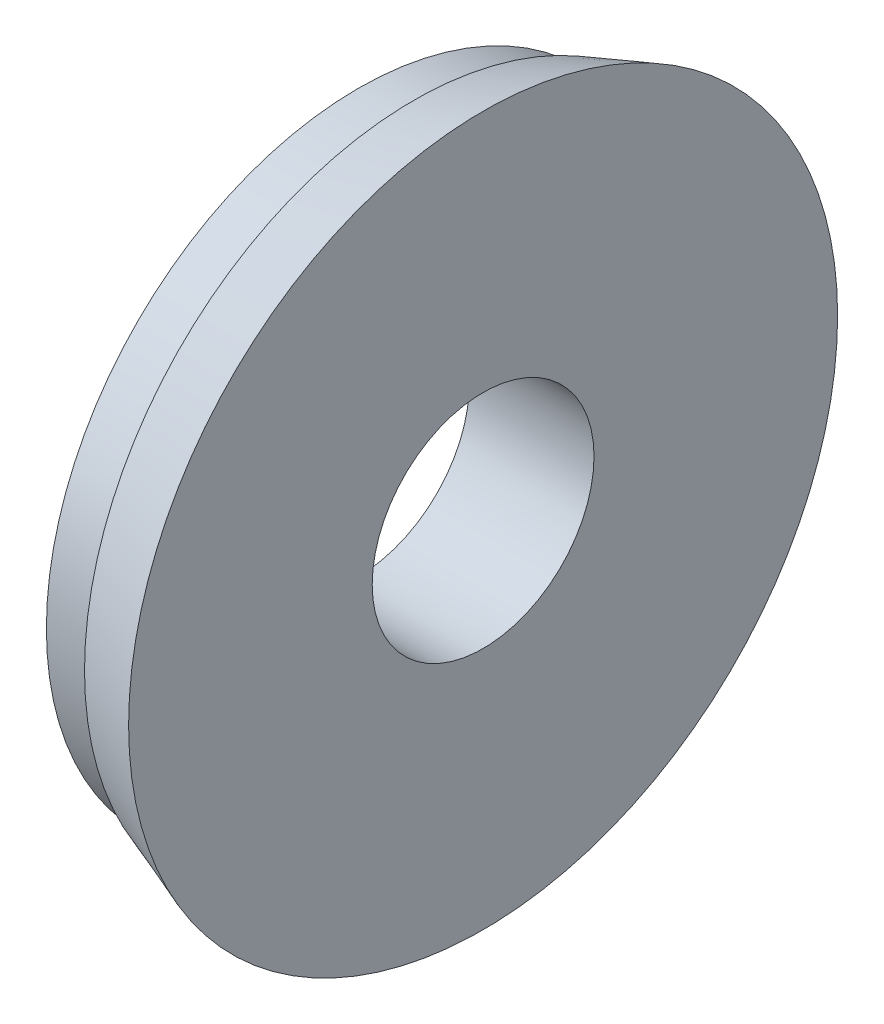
ISO-10303-21;
HEADER;
FILE_DESCRIPTION(('STEP AP214'),'2;1');
FILE_NAME('part.step','',(''),(''),'','','');
FILE_SCHEMA(('AUTOMOTIVE_DESIGN { 1 0 10303 214 1 1 1 1 }'));
ENDSEC;
DATA;
#1=APPLICATION_CONTEXT('core data for automotive mechanical design processes');
#2=APPLICATION_PROTOCOL_DEFINITION('international standard','automotive_design',2000,#1);
#3=PRODUCT_CONTEXT('',#1,'mechanical');
#4=PRODUCT('Part','Part','',(#3));
#5=PRODUCT_RELATED_PRODUCT_CATEGORY('part','',(#4));
#6=PRODUCT_DEFINITION_FORMATION('','',#4);
#7=PRODUCT_DEFINITION_CONTEXT('part definition',#1,'design');
#8=PRODUCT_DEFINITION('design','',#6,#7);
#9=PRODUCT_DEFINITION_SHAPE('','',#8);
#10=(LENGTH_UNIT() NAMED_UNIT(*) SI_UNIT(.MILLI.,.METRE.));
#11=(NAMED_UNIT(*) PLANE_ANGLE_UNIT() SI_UNIT($,.RADIAN.));
#12=(NAMED_UNIT(*) SI_UNIT($,.STERADIAN.) SOLID_ANGLE_UNIT());
#13=UNCERTAINTY_MEASURE_WITH_UNIT(LENGTH_MEASURE(1.E-05),#10,'distance_accuracy_value','');
#14=(GEOMETRIC_REPRESENTATION_CONTEXT(3) GLOBAL_UNCERTAINTY_ASSIGNED_CONTEXT((#13)) GLOBAL_UNIT_ASSIGNED_CONTEXT((#10,
#11,#12)) REPRESENTATION_CONTEXT('',''));
#15=CARTESIAN_POINT('',(0.,0.,0.));
#16=DIRECTION('',(0.,0.,1.));
#17=DIRECTION('',(1.,0.,0.));
#18=AXIS2_PLACEMENT_3D('',#15,#16,#17);
#19=CARTESIAN_POINT('',(-34.9249999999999,0.,0.));
#20=DIRECTION('',(-1.,0.,0.));
#21=DIRECTION('',(0.,0.,1.));
#22=AXIS2_PLACEMENT_3D('',#19,#20,#21);
#23=CYLINDRICAL_SURFACE('',#22,3.2);
#24=CARTESIAN_POINT('',(-1.6,0.,0.));
#25=DIRECTION('',(-1.,0.,0.));
#26=DIRECTION('',(0.,0.,1.));
#27=AXIS2_PLACEMENT_3D('',#24,#25,#26);
#28=CIRCLE('',#27,3.2);
#29=CARTESIAN_POINT('',(-1.6,0.,3.2));
#30=VERTEX_POINT('',#29);
#31=EDGE_CURVE('E41',#30,#30,#28,.T.);
#32=ORIENTED_EDGE('',*,*,#31,.T.);
#33=EDGE_LOOP('',(#32));
#34=FACE_BOUND('',#33,.T.);
#35=CARTESIAN_POINT('',(2.,0.,0.));
#36=DIRECTION('',(1.,0.,0.));
#37=DIRECTION('',(0.,0.,-1.));
#38=AXIS2_PLACEMENT_3D('',#35,#36,#37);
#39=CIRCLE('',#38,3.2);
#40=CARTESIAN_POINT('',(2.,0.,-3.2));
#41=VERTEX_POINT('',#40);
#42=EDGE_CURVE('E57',#41,#41,#39,.F.);
#43=ORIENTED_EDGE('',*,*,#42,.F.);
#44=EDGE_LOOP('',(#43));
#45=FACE_BOUND('',#44,.T.);
#46=ADVANCED_FACE('F35',(#34,#45),#23,.F.);
#47=CARTESIAN_POINT('',(-34.9249999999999,0.,0.));
#48=DIRECTION('',(-1.,0.,0.));
#49=DIRECTION('',(0.,0.,1.));
#50=AXIS2_PLACEMENT_3D('',#47,#48,#49);
#51=CYLINDRICAL_SURFACE('',#50,9.);
#52=CARTESIAN_POINT('',(-1.6,0.,0.));
#53=DIRECTION('',(-1.,0.,0.));
#54=DIRECTION('',(0.,0.,1.));
#55=AXIS2_PLACEMENT_3D('',#52,#53,#54);
#56=CIRCLE('',#55,9.);
#57=CARTESIAN_POINT('',(-1.6,0.,9.));
#58=VERTEX_POINT('',#57);
#59=EDGE_CURVE('E10',#58,#58,#56,.T.);
#60=ORIENTED_EDGE('',*,*,#59,.F.);
#61=EDGE_LOOP('',(#60));
#62=FACE_BOUND('',#61,.T.);
#63=CARTESIAN_POINT('',(0.,0.,0.));
#64=DIRECTION('',(1.,0.,0.));
#65=DIRECTION('',(0.,0.,-1.));
#66=AXIS2_PLACEMENT_3D('',#63,#64,#65);
#67=CIRCLE('',#66,9.);
#68=CARTESIAN_POINT('',(0.,0.,-9.));
#69=VERTEX_POINT('',#68);
#70=EDGE_CURVE('E45',#69,#69,#67,.T.);
#71=ORIENTED_EDGE('',*,*,#70,.F.);
#72=EDGE_LOOP('',(#71));
#73=FACE_BOUND('',#72,.T.);
#74=ADVANCED_FACE('F65',(#62,#73),#51,.T.);
#75=CARTESIAN_POINT('',(-1.6,9.,0.));
#76=DIRECTION('',(1.,0.,0.));
#77=DIRECTION('',(0.,0.,-1.));
#78=AXIS2_PLACEMENT_3D('',#75,#76,#77);
#79=PLANE('',#78);
#80=ORIENTED_EDGE('',*,*,#31,.F.);
#81=EDGE_LOOP('',(#80));
#82=FACE_BOUND('',#81,.T.);
#83=ORIENTED_EDGE('',*,*,#59,.T.);
#84=EDGE_LOOP('',(#83));
#85=FACE_BOUND('',#84,.T.);
#86=ADVANCED_FACE('F69',(#82,#85),#79,.F.);
#87=CARTESIAN_POINT('',(2.,0.,0.));
#88=DIRECTION('',(1.,0.,0.));
#89=DIRECTION('',(0.,0.,-1.));
#90=AXIS2_PLACEMENT_3D('',#87,#88,#89);
#91=PLANE('',#90);
#92=ORIENTED_EDGE('',*,*,#42,.T.);
#93=EDGE_LOOP('',(#92));
#94=FACE_BOUND('',#93,.T.);
#95=CARTESIAN_POINT('',(2.,0.,0.));
#96=DIRECTION('',(1.,0.,0.));
#97=DIRECTION('',(0.,0.,-1.));
#98=AXIS2_PLACEMENT_3D('',#95,#96,#97);
#99=CIRCLE('',#98,10.2279404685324);
#100=CARTESIAN_POINT('',(2.,0.,-10.2279404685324));
#101=VERTEX_POINT('',#100);
#102=EDGE_CURVE('E49',#101,#101,#99,.T.);
#103=ORIENTED_EDGE('',*,*,#102,.T.);
#104=EDGE_LOOP('',(#103));
#105=FACE_BOUND('',#104,.T.);
#106=ADVANCED_FACE('F61',(#94,#105),#91,.T.);
#107=CARTESIAN_POINT('',(0.,0.,0.));
#108=DIRECTION('',(1.,0.,0.));
#109=DIRECTION('',(0.,0.,-1.));
#110=AXIS2_PLACEMENT_3D('',#107,#108,#109);
#111=CONICAL_SURFACE('',#110,9.5,0.349065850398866);
#112=ORIENTED_EDGE('',*,*,#102,.F.);
#113=EDGE_LOOP('',(#112));
#114=FACE_BOUND('',#113,.T.);
#115=CARTESIAN_POINT('',(0.,0.,0.));
#116=DIRECTION('',(1.,0.,0.));
#117=DIRECTION('',(0.,0.,-1.));
#118=AXIS2_PLACEMENT_3D('',#115,#116,#117);
#119=CIRCLE('',#118,9.5);
#120=CARTESIAN_POINT('',(0.,0.,-9.5));
#121=VERTEX_POINT('',#120);
#122=EDGE_CURVE('E54',#121,#121,#119,.T.);
#123=ORIENTED_EDGE('',*,*,#122,.T.);
#124=EDGE_LOOP('',(#123));
#125=FACE_BOUND('',#124,.T.);
#126=ADVANCED_FACE('F78',(#114,#125),#111,.T.);
#127=CARTESIAN_POINT('',(0.,0.,0.));
#128=DIRECTION('',(1.,0.,0.));
#129=DIRECTION('',(0.,0.,-1.));
#130=AXIS2_PLACEMENT_3D('',#127,#128,#129);
#131=PLANE('',#130);
#132=ORIENTED_EDGE('',*,*,#122,.F.);
#133=EDGE_LOOP('',(#132));
#134=FACE_BOUND('',#133,.T.);
#135=ORIENTED_EDGE('',*,*,#70,.T.);
#136=EDGE_LOOP('',(#135));
#137=FACE_BOUND('',#136,.T.);
#138=ADVANCED_FACE('F81',(#134,#137),#131,.F.);
#139=CLOSED_SHELL('',(#46,#74,#86,#106,#126,#138));
#140=MANIFOLD_SOLID_BREP('B2',#139);
#141=ADVANCED_BREP_SHAPE_REPRESENTATION('',(#18,#140),#14);
#142=SHAPE_DEFINITION_REPRESENTATION(#9,#141);
ENDSEC;
END-ISO-10303-21;
